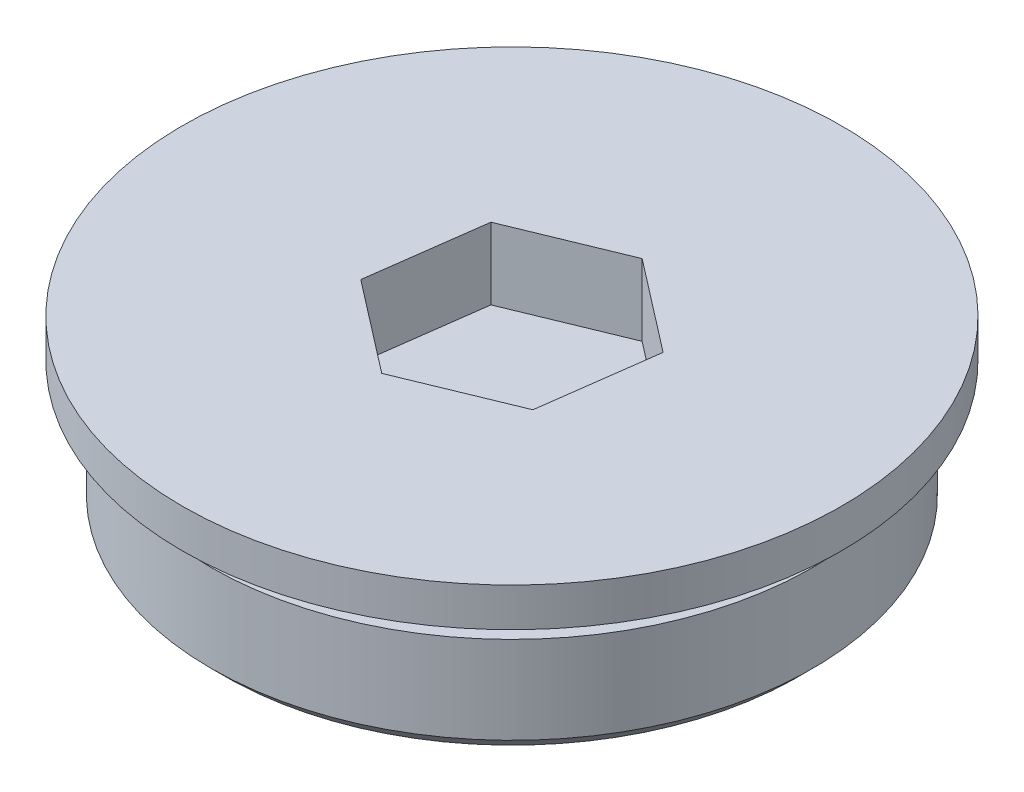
ISO-10303-21;
HEADER;
FILE_DESCRIPTION(('STEP AP214'),'2;1');
FILE_NAME('part.step','',(''),(''),'','','');
FILE_SCHEMA(('AUTOMOTIVE_DESIGN { 1 0 10303 214 1 1 1 1 }'));
ENDSEC;
DATA;
#1=APPLICATION_CONTEXT('core data for automotive mechanical design processes');
#2=APPLICATION_PROTOCOL_DEFINITION('international standard','automotive_design',2000,#1);
#3=PRODUCT_CONTEXT('',#1,'mechanical');
#4=PRODUCT('Part','Part','',(#3));
#5=PRODUCT_RELATED_PRODUCT_CATEGORY('part','',(#4));
#6=PRODUCT_DEFINITION_FORMATION('','',#4);
#7=PRODUCT_DEFINITION_CONTEXT('part definition',#1,'design');
#8=PRODUCT_DEFINITION('design','',#6,#7);
#9=PRODUCT_DEFINITION_SHAPE('','',#8);
#10=(LENGTH_UNIT() NAMED_UNIT(*) SI_UNIT(.MILLI.,.METRE.));
#11=(NAMED_UNIT(*) PLANE_ANGLE_UNIT() SI_UNIT($,.RADIAN.));
#12=(NAMED_UNIT(*) SI_UNIT($,.STERADIAN.) SOLID_ANGLE_UNIT());
#13=UNCERTAINTY_MEASURE_WITH_UNIT(LENGTH_MEASURE(1.E-05),#10,'distance_accuracy_value','');
#14=(GEOMETRIC_REPRESENTATION_CONTEXT(3) GLOBAL_UNCERTAINTY_ASSIGNED_CONTEXT((#13)) GLOBAL_UNIT_ASSIGNED_CONTEXT((#10,
#11,#12)) REPRESENTATION_CONTEXT('',''));
#15=CARTESIAN_POINT('',(0.,0.,0.));
#16=DIRECTION('',(0.,0.,1.));
#17=DIRECTION('',(1.,0.,0.));
#18=AXIS2_PLACEMENT_3D('',#15,#16,#17);
#19=CARTESIAN_POINT('',(0.,0.,0.));
#20=DIRECTION('',(0.,-1.,0.));
#21=DIRECTION('',(0.,0.,-1.));
#22=AXIS2_PLACEMENT_3D('',#19,#20,#21);
#23=PLANE('',#22);
#24=CARTESIAN_POINT('',(0.,0.,0.));
#25=DIRECTION('',(0.,1.,0.));
#26=DIRECTION('',(0.,0.,1.));
#27=AXIS2_PLACEMENT_3D('',#24,#25,#26);
#28=CIRCLE('',#27,19.);
#29=CARTESIAN_POINT('',(0.,0.,19.));
#30=VERTEX_POINT('',#29);
#31=EDGE_CURVE('E155',#30,#30,#28,.T.);
#32=ORIENTED_EDGE('',*,*,#31,.F.);
#33=EDGE_LOOP('',(#32));
#34=FACE_BOUND('',#33,.T.);
#35=ADVANCED_FACE('F29',(#34),#23,.T.);
#36=CARTESIAN_POINT('',(0.,63.,0.));
#37=DIRECTION('',(0.,1.,0.));
#38=DIRECTION('',(0.,0.,1.));
#39=AXIS2_PLACEMENT_3D('',#36,#37,#38);
#40=CYLINDRICAL_SURFACE('',#39,19.);
#41=ORIENTED_EDGE('',*,*,#31,.T.);
#42=EDGE_LOOP('',(#41));
#43=FACE_BOUND('',#42,.T.);
#44=CARTESIAN_POINT('',(0.,-2.,0.));
#45=DIRECTION('',(0.,1.,0.));
#46=DIRECTION('',(0.,0.,1.));
#47=AXIS2_PLACEMENT_3D('',#44,#45,#46);
#48=CIRCLE('',#47,19.);
#49=CARTESIAN_POINT('',(0.,-2.,19.));
#50=VERTEX_POINT('',#49);
#51=EDGE_CURVE('E152',#50,#50,#48,.T.);
#52=ORIENTED_EDGE('',*,*,#51,.F.);
#53=EDGE_LOOP('',(#52));
#54=FACE_BOUND('',#53,.T.);
#55=ADVANCED_FACE('F178',(#43,#54),#40,.F.);
#56=CARTESIAN_POINT('',(-19.,-2.,0.));
#57=DIRECTION('',(0.,-1.,0.));
#58=DIRECTION('',(0.,0.,-1.));
#59=AXIS2_PLACEMENT_3D('',#56,#57,#58);
#60=PLANE('',#59);
#61=CARTESIAN_POINT('',(0.,-2.,0.));
#62=DIRECTION('',(0.,-1.,0.));
#63=DIRECTION('',(0.,0.,-1.));
#64=AXIS2_PLACEMENT_3D('',#61,#62,#63);
#65=CIRCLE('',#64,20.);
#66=CARTESIAN_POINT('',(0.,-2.,-20.));
#67=VERTEX_POINT('',#66);
#68=EDGE_CURVE('E11',#67,#67,#65,.T.);
#69=ORIENTED_EDGE('',*,*,#68,.T.);
#70=EDGE_LOOP('',(#69));
#71=FACE_BOUND('',#70,.T.);
#72=ORIENTED_EDGE('',*,*,#51,.T.);
#73=EDGE_LOOP('',(#72));
#74=FACE_BOUND('',#73,.T.);
#75=ADVANCED_FACE('F183',(#71,#74),#60,.T.);
#76=CARTESIAN_POINT('',(0.,63.,0.));
#77=DIRECTION('',(0.,1.,0.));
#78=DIRECTION('',(0.,0.,1.));
#79=AXIS2_PLACEMENT_3D('',#76,#77,#78);
#80=CYLINDRICAL_SURFACE('',#79,21.);
#81=CARTESIAN_POINT('',(0.,-1.,0.));
#82=DIRECTION('',(0.,-1.,0.));
#83=DIRECTION('',(0.,0.,-1.));
#84=AXIS2_PLACEMENT_3D('',#81,#82,#83);
#85=CIRCLE('',#84,21.);
#86=CARTESIAN_POINT('',(0.,-1.,-21.));
#87=VERTEX_POINT('',#86);
#88=EDGE_CURVE('E36',#87,#87,#85,.F.);
#89=ORIENTED_EDGE('',*,*,#88,.T.);
#90=EDGE_LOOP('',(#89));
#91=FACE_BOUND('',#90,.T.);
#92=CARTESIAN_POINT('',(0.,5.09999999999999,0.));
#93=DIRECTION('',(0.,1.,0.));
#94=DIRECTION('',(0.,0.,1.));
#95=AXIS2_PLACEMENT_3D('',#92,#93,#94);
#96=CIRCLE('',#95,21.);
#97=CARTESIAN_POINT('',(0.,5.09999999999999,21.));
#98=VERTEX_POINT('',#97);
#99=EDGE_CURVE('E149',#98,#98,#96,.T.);
#100=ORIENTED_EDGE('',*,*,#99,.F.);
#101=EDGE_LOOP('',(#100));
#102=FACE_BOUND('',#101,.T.);
#103=ADVANCED_FACE('F160',(#91,#102),#80,.T.);
#104=CARTESIAN_POINT('',(-21.,5.1,0.));
#105=DIRECTION('',(0.,1.,0.));
#106=DIRECTION('',(0.,0.,1.));
#107=AXIS2_PLACEMENT_3D('',#104,#105,#106);
#108=PLANE('',#107);
#109=ORIENTED_EDGE('',*,*,#99,.T.);
#110=EDGE_LOOP('',(#109));
#111=FACE_BOUND('',#110,.T.);
#112=CARTESIAN_POINT('',(0.,5.09999999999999,0.));
#113=DIRECTION('',(0.,1.,0.));
#114=DIRECTION('',(0.,0.,1.));
#115=AXIS2_PLACEMENT_3D('',#112,#113,#114);
#116=CIRCLE('',#115,20.);
#117=CARTESIAN_POINT('',(0.,5.09999999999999,20.));
#118=VERTEX_POINT('',#117);
#119=EDGE_CURVE('E146',#118,#118,#116,.T.);
#120=ORIENTED_EDGE('',*,*,#119,.F.);
#121=EDGE_LOOP('',(#120));
#122=FACE_BOUND('',#121,.T.);
#123=ADVANCED_FACE('F195',(#111,#122),#108,.T.);
#124=CARTESIAN_POINT('',(0.,63.,0.));
#125=DIRECTION('',(0.,1.,0.));
#126=DIRECTION('',(0.,0.,1.));
#127=AXIS2_PLACEMENT_3D('',#124,#125,#126);
#128=CYLINDRICAL_SURFACE('',#127,20.);
#129=ORIENTED_EDGE('',*,*,#119,.T.);
#130=EDGE_LOOP('',(#129));
#131=FACE_BOUND('',#130,.T.);
#132=CARTESIAN_POINT('',(0.,7.1,0.));
#133=DIRECTION('',(0.,1.,0.));
#134=DIRECTION('',(0.,0.,1.));
#135=AXIS2_PLACEMENT_3D('',#132,#133,#134);
#136=CIRCLE('',#135,20.);
#137=CARTESIAN_POINT('',(0.,7.1,20.));
#138=VERTEX_POINT('',#137);
#139=EDGE_CURVE('E143',#138,#138,#136,.T.);
#140=ORIENTED_EDGE('',*,*,#139,.F.);
#141=EDGE_LOOP('',(#140));
#142=FACE_BOUND('',#141,.T.);
#143=ADVANCED_FACE('F200',(#131,#142),#128,.T.);
#144=CARTESIAN_POINT('',(-20.,7.1,0.));
#145=DIRECTION('',(0.,-1.,0.));
#146=DIRECTION('',(0.,0.,-1.));
#147=AXIS2_PLACEMENT_3D('',#144,#145,#146);
#148=PLANE('',#147);
#149=ORIENTED_EDGE('',*,*,#139,.T.);
#150=EDGE_LOOP('',(#149));
#151=FACE_BOUND('',#150,.T.);
#152=CARTESIAN_POINT('',(0.,7.1,0.));
#153=DIRECTION('',(0.,1.,0.));
#154=DIRECTION('',(0.,0.,1.));
#155=AXIS2_PLACEMENT_3D('',#152,#153,#154);
#156=CIRCLE('',#155,23.);
#157=CARTESIAN_POINT('',(0.,7.1,23.));
#158=VERTEX_POINT('',#157);
#159=EDGE_CURVE('E140',#158,#158,#156,.T.);
#160=ORIENTED_EDGE('',*,*,#159,.F.);
#161=EDGE_LOOP('',(#160));
#162=FACE_BOUND('',#161,.T.);
#163=ADVANCED_FACE('F204',(#151,#162),#148,.T.);
#164=CARTESIAN_POINT('',(0.,63.,0.));
#165=DIRECTION('',(0.,1.,0.));
#166=DIRECTION('',(0.,0.,1.));
#167=AXIS2_PLACEMENT_3D('',#164,#165,#166);
#168=CYLINDRICAL_SURFACE('',#167,23.);
#169=ORIENTED_EDGE('',*,*,#159,.T.);
#170=EDGE_LOOP('',(#169));
#171=FACE_BOUND('',#170,.T.);
#172=CARTESIAN_POINT('',(0.,9.8,0.));
#173=DIRECTION('',(0.,1.,0.));
#174=DIRECTION('',(0.,0.,1.));
#175=AXIS2_PLACEMENT_3D('',#172,#173,#174);
#176=CIRCLE('',#175,23.);
#177=CARTESIAN_POINT('',(0.,9.8,23.));
#178=VERTEX_POINT('',#177);
#179=EDGE_CURVE('E131',#178,#178,#176,.T.);
#180=ORIENTED_EDGE('',*,*,#179,.F.);
#181=EDGE_LOOP('',(#180));
#182=FACE_BOUND('',#181,.T.);
#183=ADVANCED_FACE('F174',(#171,#182),#168,.T.);
#184=CARTESIAN_POINT('',(-23.,9.8,0.));
#185=DIRECTION('',(0.,1.,0.));
#186=DIRECTION('',(0.,0.,1.));
#187=AXIS2_PLACEMENT_3D('',#184,#185,#186);
#188=PLANE('',#187);
#189=DIRECTION('',(0.791807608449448,0.,0.610770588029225));
#190=VECTOR('',#189,1.);
#191=CARTESIAN_POINT('',(-7.47544646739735,9.8,3.07425331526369));
#192=LINE('',#191,#190);
#193=CARTESIAN_POINT('',(-7.47544646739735,9.8,3.07425331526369));
#194=VERTEX_POINT('',#193);
#195=CARTESIAN_POINT('',(-1.07534176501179,9.8,8.01105320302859));
#196=VERTEX_POINT('',#195);
#197=EDGE_CURVE('E43',#194,#196,#192,.T.);
#198=ORIENTED_EDGE('',*,*,#197,.F.);
#199=DIRECTION('',(-0.133039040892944,0.,0.991110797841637));
#200=VECTOR('',#199,1.);
#201=CARTESIAN_POINT('',(-6.40010470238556,9.8,-4.9367998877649));
#202=LINE('',#201,#200);
#203=CARTESIAN_POINT('',(-6.40010470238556,9.8,-4.9367998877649));
#204=VERTEX_POINT('',#203);
#205=EDGE_CURVE('E113',#204,#194,#202,.T.);
#206=ORIENTED_EDGE('',*,*,#205,.F.);
#207=DIRECTION('',(-0.924846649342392,0.,0.380340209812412));
#208=VECTOR('',#207,1.);
#209=CARTESIAN_POINT('',(1.07534176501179,9.8,-8.01105320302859));
#210=LINE('',#209,#208);
#211=CARTESIAN_POINT('',(1.07534176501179,9.8,-8.01105320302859));
#212=VERTEX_POINT('',#211);
#213=EDGE_CURVE('E107',#212,#204,#210,.T.);
#214=ORIENTED_EDGE('',*,*,#213,.F.);
#215=DIRECTION('',(-0.791807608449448,0.,-0.610770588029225));
#216=VECTOR('',#215,1.);
#217=CARTESIAN_POINT('',(7.47544646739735,9.8,-3.07425331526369));
#218=LINE('',#217,#216);
#219=CARTESIAN_POINT('',(7.47544646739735,9.8,-3.07425331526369));
#220=VERTEX_POINT('',#219);
#221=EDGE_CURVE('E105',#220,#212,#218,.T.);
#222=ORIENTED_EDGE('',*,*,#221,.F.);
#223=DIRECTION('',(0.133039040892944,0.,-0.991110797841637));
#224=VECTOR('',#223,1.);
#225=CARTESIAN_POINT('',(6.40010470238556,9.8,4.9367998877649));
#226=LINE('',#225,#224);
#227=CARTESIAN_POINT('',(6.40010470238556,9.8,4.9367998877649));
#228=VERTEX_POINT('',#227);
#229=EDGE_CURVE('E86',#228,#220,#226,.T.);
#230=ORIENTED_EDGE('',*,*,#229,.F.);
#231=DIRECTION('',(0.924846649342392,0.,-0.380340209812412));
#232=VECTOR('',#231,1.);
#233=CARTESIAN_POINT('',(-1.07534176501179,9.8,8.0110532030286));
#234=LINE('',#233,#232);
#235=EDGE_CURVE('E97',#196,#228,#234,.T.);
#236=ORIENTED_EDGE('',*,*,#235,.F.);
#237=EDGE_LOOP('',(#198,#206,#214,#222,#230,#236));
#238=FACE_BOUND('',#237,.T.);
#239=ORIENTED_EDGE('',*,*,#179,.T.);
#240=EDGE_LOOP('',(#239));
#241=FACE_BOUND('',#240,.T.);
#242=ADVANCED_FACE('F101',(#238,#241),#188,.T.);
#243=CARTESIAN_POINT('',(0.,-1.,0.));
#244=DIRECTION('',(0.,1.,0.));
#245=DIRECTION('',(0.,0.,1.));
#246=AXIS2_PLACEMENT_3D('',#243,#244,#245);
#247=CONICAL_SURFACE('',#246,21.,0.78539816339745);
#248=ORIENTED_EDGE('',*,*,#68,.F.);
#249=EDGE_LOOP('',(#248));
#250=FACE_BOUND('',#249,.T.);
#251=ORIENTED_EDGE('',*,*,#88,.F.);
#252=EDGE_LOOP('',(#251));
#253=FACE_BOUND('',#252,.T.);
#254=ADVANCED_FACE('F163',(#250,#253),#247,.T.);
#255=CARTESIAN_POINT('',(-7.47544646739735,4.8,3.07425331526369));
#256=DIRECTION('',(-0.610770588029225,0.,0.791807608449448));
#257=DIRECTION('',(0.791807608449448,0.,0.610770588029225));
#258=AXIS2_PLACEMENT_3D('',#255,#256,#257);
#259=PLANE('',#258);
#260=ORIENTED_EDGE('',*,*,#197,.T.);
#261=DIRECTION('',(0.,1.,0.));
#262=VECTOR('',#261,1.);
#263=CARTESIAN_POINT('',(-1.07534176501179,4.8,8.0110532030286));
#264=LINE('',#263,#262);
#265=CARTESIAN_POINT('',(-1.07534176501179,4.8,8.0110532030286));
#266=VERTEX_POINT('',#265);
#267=EDGE_CURVE('E94',#266,#196,#264,.T.);
#268=ORIENTED_EDGE('',*,*,#267,.F.);
#269=DIRECTION('',(0.791807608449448,0.,0.610770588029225));
#270=VECTOR('',#269,1.);
#271=CARTESIAN_POINT('',(-7.47544646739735,4.8,3.07425331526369));
#272=LINE('',#271,#270);
#273=CARTESIAN_POINT('',(-7.47544646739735,4.8,3.07425331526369));
#274=VERTEX_POINT('',#273);
#275=EDGE_CURVE('E115',#274,#266,#272,.T.);
#276=ORIENTED_EDGE('',*,*,#275,.F.);
#277=DIRECTION('',(0.,1.,0.));
#278=VECTOR('',#277,1.);
#279=CARTESIAN_POINT('',(-7.47544646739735,4.8,3.07425331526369));
#280=LINE('',#279,#278);
#281=EDGE_CURVE('E50',#274,#194,#280,.T.);
#282=ORIENTED_EDGE('',*,*,#281,.T.);
#283=EDGE_LOOP('',(#260,#268,#276,#282));
#284=FACE_BOUND('',#283,.T.);
#285=ADVANCED_FACE('F165',(#284),#259,.F.);
#286=CARTESIAN_POINT('',(-6.40010470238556,4.8,-4.9367998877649));
#287=DIRECTION('',(-0.991110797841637,0.,-0.133039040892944));
#288=DIRECTION('',(-0.133039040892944,0.,0.991110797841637));
#289=AXIS2_PLACEMENT_3D('',#286,#287,#288);
#290=PLANE('',#289);
#291=ORIENTED_EDGE('',*,*,#205,.T.);
#292=ORIENTED_EDGE('',*,*,#281,.F.);
#293=DIRECTION('',(-0.133039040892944,0.,0.991110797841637));
#294=VECTOR('',#293,1.);
#295=CARTESIAN_POINT('',(-6.40010470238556,4.8,-4.9367998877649));
#296=LINE('',#295,#294);
#297=CARTESIAN_POINT('',(-6.40010470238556,4.8,-4.9367998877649));
#298=VERTEX_POINT('',#297);
#299=EDGE_CURVE('E127',#298,#274,#296,.T.);
#300=ORIENTED_EDGE('',*,*,#299,.F.);
#301=DIRECTION('',(0.,1.,0.));
#302=VECTOR('',#301,1.);
#303=CARTESIAN_POINT('',(-6.40010470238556,4.8,-4.9367998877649));
#304=LINE('',#303,#302);
#305=EDGE_CURVE('E132',#298,#204,#304,.T.);
#306=ORIENTED_EDGE('',*,*,#305,.T.);
#307=EDGE_LOOP('',(#291,#292,#300,#306));
#308=FACE_BOUND('',#307,.T.);
#309=ADVANCED_FACE('F172',(#308),#290,.F.);
#310=CARTESIAN_POINT('',(1.07534176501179,4.8,-8.01105320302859));
#311=DIRECTION('',(-0.380340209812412,0.,-0.924846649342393));
#312=DIRECTION('',(-0.924846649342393,0.,0.380340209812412));
#313=AXIS2_PLACEMENT_3D('',#310,#311,#312);
#314=PLANE('',#313);
#315=ORIENTED_EDGE('',*,*,#213,.T.);
#316=ORIENTED_EDGE('',*,*,#305,.F.);
#317=DIRECTION('',(-0.924846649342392,0.,0.380340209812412));
#318=VECTOR('',#317,1.);
#319=CARTESIAN_POINT('',(1.07534176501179,4.8,-8.01105320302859));
#320=LINE('',#319,#318);
#321=CARTESIAN_POINT('',(1.07534176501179,4.8,-8.01105320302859));
#322=VERTEX_POINT('',#321);
#323=EDGE_CURVE('E124',#322,#298,#320,.T.);
#324=ORIENTED_EDGE('',*,*,#323,.F.);
#325=DIRECTION('',(0.,1.,0.));
#326=VECTOR('',#325,1.);
#327=CARTESIAN_POINT('',(1.07534176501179,4.8,-8.01105320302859));
#328=LINE('',#327,#326);
#329=EDGE_CURVE('E134',#322,#212,#328,.T.);
#330=ORIENTED_EDGE('',*,*,#329,.T.);
#331=EDGE_LOOP('',(#315,#316,#324,#330));
#332=FACE_BOUND('',#331,.T.);
#333=ADVANCED_FACE('F242',(#332),#314,.F.);
#334=CARTESIAN_POINT('',(7.47544646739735,4.8,-3.07425331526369));
#335=DIRECTION('',(0.610770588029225,0.,-0.791807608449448));
#336=DIRECTION('',(-0.791807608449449,0.,-0.610770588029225));
#337=AXIS2_PLACEMENT_3D('',#334,#335,#336);
#338=PLANE('',#337);
#339=ORIENTED_EDGE('',*,*,#221,.T.);
#340=ORIENTED_EDGE('',*,*,#329,.F.);
#341=DIRECTION('',(-0.791807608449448,0.,-0.610770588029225));
#342=VECTOR('',#341,1.);
#343=CARTESIAN_POINT('',(7.47544646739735,4.8,-3.07425331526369));
#344=LINE('',#343,#342);
#345=CARTESIAN_POINT('',(7.47544646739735,4.8,-3.07425331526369));
#346=VERTEX_POINT('',#345);
#347=EDGE_CURVE('E121',#346,#322,#344,.T.);
#348=ORIENTED_EDGE('',*,*,#347,.F.);
#349=DIRECTION('',(0.,1.,0.));
#350=VECTOR('',#349,1.);
#351=CARTESIAN_POINT('',(7.47544646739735,4.8,-3.07425331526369));
#352=LINE('',#351,#350);
#353=EDGE_CURVE('E93',#346,#220,#352,.T.);
#354=ORIENTED_EDGE('',*,*,#353,.T.);
#355=EDGE_LOOP('',(#339,#340,#348,#354));
#356=FACE_BOUND('',#355,.T.);
#357=ADVANCED_FACE('F251',(#356),#338,.F.);
#358=CARTESIAN_POINT('',(6.40010470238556,4.8,4.9367998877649));
#359=DIRECTION('',(0.991110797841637,0.,0.133039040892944));
#360=DIRECTION('',(0.133039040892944,0.,-0.991110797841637));
#361=AXIS2_PLACEMENT_3D('',#358,#359,#360);
#362=PLANE('',#361);
#363=ORIENTED_EDGE('',*,*,#229,.T.);
#364=ORIENTED_EDGE('',*,*,#353,.F.);
#365=DIRECTION('',(0.133039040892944,0.,-0.991110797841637));
#366=VECTOR('',#365,1.);
#367=CARTESIAN_POINT('',(6.40010470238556,4.8,4.9367998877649));
#368=LINE('',#367,#366);
#369=CARTESIAN_POINT('',(6.40010470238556,4.8,4.9367998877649));
#370=VERTEX_POINT('',#369);
#371=EDGE_CURVE('E89',#370,#346,#368,.T.);
#372=ORIENTED_EDGE('',*,*,#371,.F.);
#373=DIRECTION('',(0.,1.,0.));
#374=VECTOR('',#373,1.);
#375=CARTESIAN_POINT('',(6.40010470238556,4.8,4.9367998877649));
#376=LINE('',#375,#374);
#377=EDGE_CURVE('E82',#370,#228,#376,.T.);
#378=ORIENTED_EDGE('',*,*,#377,.T.);
#379=EDGE_LOOP('',(#363,#364,#372,#378));
#380=FACE_BOUND('',#379,.T.);
#381=ADVANCED_FACE('F84',(#380),#362,.F.);
#382=CARTESIAN_POINT('',(-1.07534176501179,4.8,8.0110532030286));
#383=DIRECTION('',(0.380340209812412,0.,0.924846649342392));
#384=DIRECTION('',(0.924846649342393,0.,-0.380340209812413));
#385=AXIS2_PLACEMENT_3D('',#382,#383,#384);
#386=PLANE('',#385);
#387=ORIENTED_EDGE('',*,*,#235,.T.);
#388=ORIENTED_EDGE('',*,*,#377,.F.);
#389=DIRECTION('',(0.924846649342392,0.,-0.380340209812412));
#390=VECTOR('',#389,1.);
#391=CARTESIAN_POINT('',(-1.07534176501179,4.8,8.0110532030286));
#392=LINE('',#391,#390);
#393=EDGE_CURVE('E118',#266,#370,#392,.T.);
#394=ORIENTED_EDGE('',*,*,#393,.F.);
#395=ORIENTED_EDGE('',*,*,#267,.T.);
#396=EDGE_LOOP('',(#387,#388,#394,#395));
#397=FACE_BOUND('',#396,.T.);
#398=ADVANCED_FACE('F98',(#397),#386,.F.);
#399=CARTESIAN_POINT('',(-1.0753417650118,4.8,8.0110532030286));
#400=DIRECTION('',(0.,1.,0.));
#401=DIRECTION('',(0.,0.,1.));
#402=AXIS2_PLACEMENT_3D('',#399,#400,#401);
#403=PLANE('',#402);
#404=ORIENTED_EDGE('',*,*,#275,.T.);
#405=ORIENTED_EDGE('',*,*,#393,.T.);
#406=ORIENTED_EDGE('',*,*,#371,.T.);
#407=ORIENTED_EDGE('',*,*,#347,.T.);
#408=ORIENTED_EDGE('',*,*,#323,.T.);
#409=ORIENTED_EDGE('',*,*,#299,.T.);
#410=EDGE_LOOP('',(#404,#405,#406,#407,#408,#409));
#411=FACE_BOUND('',#410,.T.);
#412=ADVANCED_FACE('F278',(#411),#403,.T.);
#413=CLOSED_SHELL('',(#35,#55,#75,#103,#123,#143,#163,#183,#242,#254,#285,#309,#333,#357,#381,
#398,#412));
#414=MANIFOLD_SOLID_BREP('B2',#413);
#415=ADVANCED_BREP_SHAPE_REPRESENTATION('',(#18,#414),#14);
#416=SHAPE_DEFINITION_REPRESENTATION(#9,#415);
ENDSEC;
END-ISO-10303-21;
